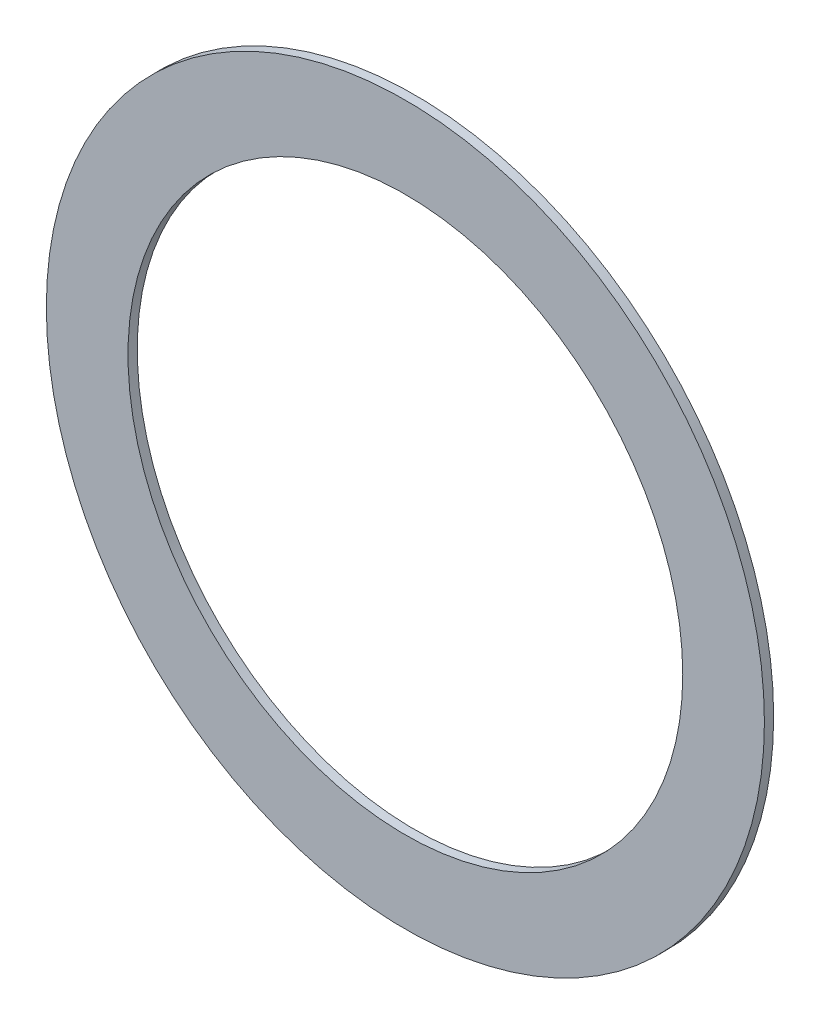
from build123d import *

# Parameters (mm, degrees)
SKIZZE1_R                    = 116.5
SKIZZE1_R_2                  = 90
BASIS_LINEAR_AUSTRAGEN_DEPTH = 3


with BuildPart() as part:
    # Skizze1 → Basis-Linear austragen (new body)
    with BuildSketch(Plane.XY):
        Circle(SKIZZE1_R)
        Circle(SKIZZE1_R_2, mode=Mode.SUBTRACT)
    extrude(amount=BASIS_LINEAR_AUSTRAGEN_DEPTH)


solid = part.part
